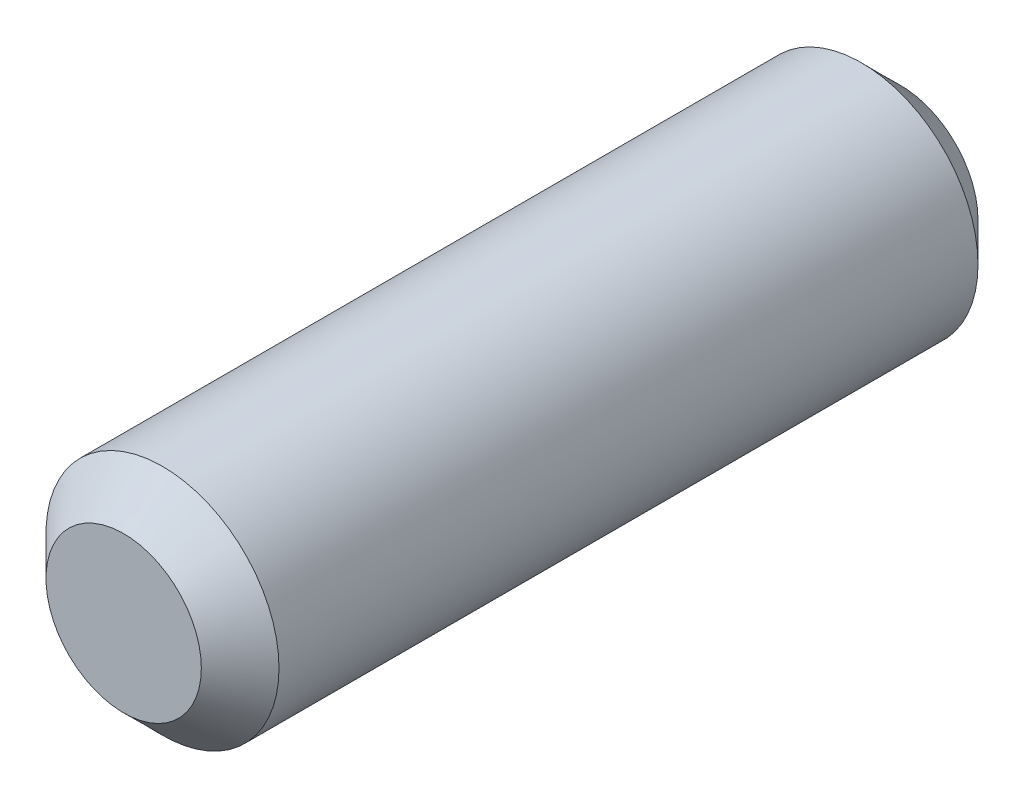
from build123d import *

# Parameters (mm, degrees)
ESQUISSE1_R      = 3
EXTRUSION1_DEPTH = 20
CHANFREIN1_SIZE  = 1


with BuildPart() as part:
    # Esquisse1 → Extrusion1 (new body)
    with BuildSketch(Plane.XY):
        Circle(ESQUISSE1_R)
    extrude(amount=EXTRUSION1_DEPTH)

    # Chanfrein1
    chanfrein1_edges = [part.edges().sort_by_distance(p)[0] for p in [
        (-3, 0, 0),
        (-3, 0, 20),
    ]]
    chamfer(chanfrein1_edges, length=CHANFREIN1_SIZE)


solid = part.part
